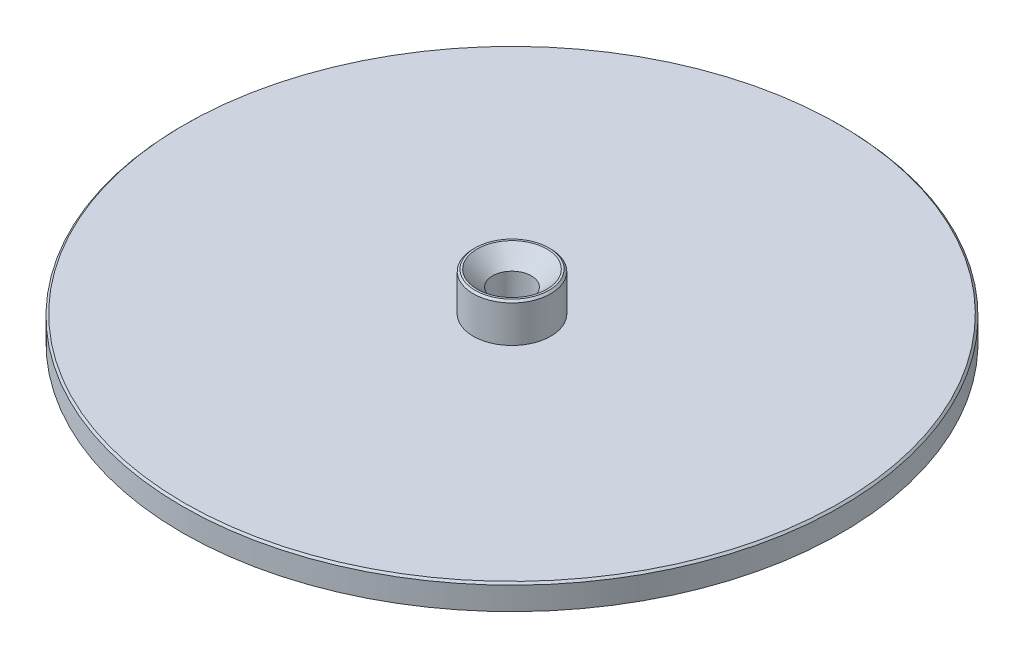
ISO-10303-21;
HEADER;
FILE_DESCRIPTION(('STEP AP214'),'2;1');
FILE_NAME('part.step','',(''),(''),'','','');
FILE_SCHEMA(('AUTOMOTIVE_DESIGN { 1 0 10303 214 1 1 1 1 }'));
ENDSEC;
DATA;
#1=APPLICATION_CONTEXT('core data for automotive mechanical design processes');
#2=APPLICATION_PROTOCOL_DEFINITION('international standard','automotive_design',2000,#1);
#3=PRODUCT_CONTEXT('',#1,'mechanical');
#4=PRODUCT('Part','Part','',(#3));
#5=PRODUCT_RELATED_PRODUCT_CATEGORY('part','',(#4));
#6=PRODUCT_DEFINITION_FORMATION('','',#4);
#7=PRODUCT_DEFINITION_CONTEXT('part definition',#1,'design');
#8=PRODUCT_DEFINITION('design','',#6,#7);
#9=PRODUCT_DEFINITION_SHAPE('','',#8);
#10=(LENGTH_UNIT() NAMED_UNIT(*) SI_UNIT(.MILLI.,.METRE.));
#11=(NAMED_UNIT(*) PLANE_ANGLE_UNIT() SI_UNIT($,.RADIAN.));
#12=(NAMED_UNIT(*) SI_UNIT($,.STERADIAN.) SOLID_ANGLE_UNIT());
#13=UNCERTAINTY_MEASURE_WITH_UNIT(LENGTH_MEASURE(1.E-05),#10,'distance_accuracy_value','');
#14=(GEOMETRIC_REPRESENTATION_CONTEXT(3) GLOBAL_UNCERTAINTY_ASSIGNED_CONTEXT((#13)) GLOBAL_UNIT_ASSIGNED_CONTEXT((#10,
#11,#12)) REPRESENTATION_CONTEXT('',''));
#15=CARTESIAN_POINT('',(0.,0.,0.));
#16=DIRECTION('',(0.,0.,1.));
#17=DIRECTION('',(1.,0.,0.));
#18=AXIS2_PLACEMENT_3D('',#15,#16,#17);
#19=CARTESIAN_POINT('',(0.,8.00000000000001,0.));
#20=DIRECTION('',(0.,1.,0.));
#21=DIRECTION('',(0.,0.,1.));
#22=AXIS2_PLACEMENT_3D('',#19,#20,#21);
#23=PLANE('',#22);
#24=CARTESIAN_POINT('',(0.,8.00000000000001,0.));
#25=DIRECTION('',(0.,1.,0.));
#26=DIRECTION('',(0.,0.,1.));
#27=AXIS2_PLACEMENT_3D('',#24,#25,#26);
#28=CIRCLE('',#27,84.5);
#29=CARTESIAN_POINT('',(0.,8.00000000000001,84.5));
#30=VERTEX_POINT('',#29);
#31=EDGE_CURVE('E73',#30,#30,#28,.T.);
#32=ORIENTED_EDGE('',*,*,#31,.T.);
#33=EDGE_LOOP('',(#32));
#34=FACE_BOUND('',#33,.T.);
#35=CARTESIAN_POINT('',(0.,8.00000000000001,0.));
#36=DIRECTION('',(0.,1.,0.));
#37=DIRECTION('',(0.,0.,1.));
#38=AXIS2_PLACEMENT_3D('',#35,#36,#37);
#39=CIRCLE('',#38,10.);
#40=CARTESIAN_POINT('',(0.,8.00000000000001,10.));
#41=VERTEX_POINT('',#40);
#42=EDGE_CURVE('E93',#41,#41,#39,.T.);
#43=ORIENTED_EDGE('',*,*,#42,.F.);
#44=EDGE_LOOP('',(#43));
#45=FACE_BOUND('',#44,.T.);
#46=ADVANCED_FACE('F43',(#34,#45),#23,.T.);
#47=CARTESIAN_POINT('',(0.,8.00000000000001,0.));
#48=DIRECTION('',(0.,-1.,0.));
#49=DIRECTION('',(0.,0.,-1.));
#50=AXIS2_PLACEMENT_3D('',#47,#48,#49);
#51=CYLINDRICAL_SURFACE('',#50,85.);
#52=CARTESIAN_POINT('',(0.,7.50000000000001,0.));
#53=DIRECTION('',(0.,1.,0.));
#54=DIRECTION('',(0.,0.,1.));
#55=AXIS2_PLACEMENT_3D('',#52,#53,#54);
#56=CIRCLE('',#55,85.);
#57=CARTESIAN_POINT('',(0.,7.50000000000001,85.));
#58=VERTEX_POINT('',#57);
#59=EDGE_CURVE('E69',#58,#58,#56,.F.);
#60=ORIENTED_EDGE('',*,*,#59,.T.);
#61=EDGE_LOOP('',(#60));
#62=FACE_BOUND('',#61,.T.);
#63=CARTESIAN_POINT('',(0.,1.58716815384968,0.));
#64=DIRECTION('',(0.,1.,0.));
#65=DIRECTION('',(0.,0.,1.));
#66=AXIS2_PLACEMENT_3D('',#63,#64,#65);
#67=CIRCLE('',#66,85.);
#68=CARTESIAN_POINT('',(0.,1.58716815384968,85.));
#69=VERTEX_POINT('',#68);
#70=EDGE_CURVE('E89',#69,#69,#67,.T.);
#71=ORIENTED_EDGE('',*,*,#70,.T.);
#72=EDGE_LOOP('',(#71));
#73=FACE_BOUND('',#72,.T.);
#74=ADVANCED_FACE('F102',(#62,#73),#51,.T.);
#75=CARTESIAN_POINT('',(0.,0.,0.));
#76=DIRECTION('',(0.,1.,0.));
#77=DIRECTION('',(0.,0.,1.));
#78=AXIS2_PLACEMENT_3D('',#75,#76,#77);
#79=PLANE('',#78);
#80=CARTESIAN_POINT('',(0.,0.,0.));
#81=DIRECTION('',(0.,1.,0.));
#82=DIRECTION('',(0.,0.,1.));
#83=AXIS2_PLACEMENT_3D('',#80,#81,#82);
#84=CIRCLE('',#83,8.99999999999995);
#85=CARTESIAN_POINT('',(0.,0.,8.99999999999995));
#86=VERTEX_POINT('',#85);
#87=EDGE_CURVE('E10',#86,#86,#84,.T.);
#88=ORIENTED_EDGE('',*,*,#87,.T.);
#89=EDGE_LOOP('',(#88));
#90=FACE_BOUND('',#89,.T.);
#91=CARTESIAN_POINT('',(0.,0.,0.));
#92=DIRECTION('',(0.,1.,0.));
#93=DIRECTION('',(0.,0.,1.));
#94=AXIS2_PLACEMENT_3D('',#91,#92,#93);
#95=CIRCLE('',#94,82.46);
#96=CARTESIAN_POINT('',(0.,0.,82.46));
#97=VERTEX_POINT('',#96);
#98=EDGE_CURVE('E85',#97,#97,#95,.F.);
#99=ORIENTED_EDGE('',*,*,#98,.T.);
#100=EDGE_LOOP('',(#99));
#101=FACE_BOUND('',#100,.T.);
#102=ADVANCED_FACE('F108',(#90,#101),#79,.F.);
#103=CARTESIAN_POINT('',(0.,1.58716815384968,0.));
#104=DIRECTION('',(0.,1.,0.));
#105=DIRECTION('',(0.,0.,1.));
#106=AXIS2_PLACEMENT_3D('',#103,#104,#105);
#107=CONICAL_SURFACE('',#106,85.,1.01229096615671);
#108=ORIENTED_EDGE('',*,*,#98,.F.);
#109=EDGE_LOOP('',(#108));
#110=FACE_BOUND('',#109,.T.);
#111=ORIENTED_EDGE('',*,*,#70,.F.);
#112=EDGE_LOOP('',(#111));
#113=FACE_BOUND('',#112,.T.);
#114=ADVANCED_FACE('F115',(#110,#113),#107,.T.);
#115=CARTESIAN_POINT('',(0.,18.,0.));
#116=DIRECTION('',(0.,-1.,0.));
#117=DIRECTION('',(0.,0.,-1.));
#118=AXIS2_PLACEMENT_3D('',#115,#116,#117);
#119=CYLINDRICAL_SURFACE('',#118,10.);
#120=CARTESIAN_POINT('',(0.,17.5,0.));
#121=DIRECTION('',(0.,1.,0.));
#122=DIRECTION('',(0.,0.,1.));
#123=AXIS2_PLACEMENT_3D('',#120,#121,#122);
#124=CIRCLE('',#123,10.);
#125=CARTESIAN_POINT('',(0.,17.5,10.));
#126=VERTEX_POINT('',#125);
#127=EDGE_CURVE('E77',#126,#126,#124,.F.);
#128=ORIENTED_EDGE('',*,*,#127,.T.);
#129=EDGE_LOOP('',(#128));
#130=FACE_BOUND('',#129,.T.);
#131=ORIENTED_EDGE('',*,*,#42,.T.);
#132=EDGE_LOOP('',(#131));
#133=FACE_BOUND('',#132,.T.);
#134=ADVANCED_FACE('F99',(#130,#133),#119,.T.);
#135=CARTESIAN_POINT('',(0.,18.,0.));
#136=DIRECTION('',(0.,1.,0.));
#137=DIRECTION('',(0.,0.,1.));
#138=AXIS2_PLACEMENT_3D('',#135,#136,#137);
#139=PLANE('',#138);
#140=CARTESIAN_POINT('',(0.,18.,0.));
#141=DIRECTION('',(0.,1.,0.));
#142=DIRECTION('',(0.,0.,1.));
#143=AXIS2_PLACEMENT_3D('',#140,#141,#142);
#144=CIRCLE('',#143,9.00000000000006);
#145=CARTESIAN_POINT('',(0.,18.,9.00000000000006));
#146=VERTEX_POINT('',#145);
#147=EDGE_CURVE('E51',#146,#146,#144,.F.);
#148=ORIENTED_EDGE('',*,*,#147,.T.);
#149=EDGE_LOOP('',(#148));
#150=FACE_BOUND('',#149,.T.);
#151=CARTESIAN_POINT('',(0.,18.,0.));
#152=DIRECTION('',(0.,1.,0.));
#153=DIRECTION('',(0.,0.,1.));
#154=AXIS2_PLACEMENT_3D('',#151,#152,#153);
#155=CIRCLE('',#154,9.50000000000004);
#156=CARTESIAN_POINT('',(0.,18.,9.50000000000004));
#157=VERTEX_POINT('',#156);
#158=EDGE_CURVE('E81',#157,#157,#155,.T.);
#159=ORIENTED_EDGE('',*,*,#158,.T.);
#160=EDGE_LOOP('',(#159));
#161=FACE_BOUND('',#160,.T.);
#162=ADVANCED_FACE('F124',(#150,#161),#139,.T.);
#163=CARTESIAN_POINT('',(0.,18.,0.));
#164=DIRECTION('',(0.,-1.,0.));
#165=DIRECTION('',(0.,0.,-1.));
#166=AXIS2_PLACEMENT_3D('',#163,#164,#165);
#167=CONICAL_SURFACE('',#166,9.50000000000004,0.785398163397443);
#168=ORIENTED_EDGE('',*,*,#127,.F.);
#169=EDGE_LOOP('',(#168));
#170=FACE_BOUND('',#169,.T.);
#171=ORIENTED_EDGE('',*,*,#158,.F.);
#172=EDGE_LOOP('',(#171));
#173=FACE_BOUND('',#172,.T.);
#174=ADVANCED_FACE('F120',(#170,#173),#167,.T.);
#175=CARTESIAN_POINT('',(0.,8.00000000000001,0.));
#176=DIRECTION('',(0.,-1.,0.));
#177=DIRECTION('',(0.,0.,-1.));
#178=AXIS2_PLACEMENT_3D('',#175,#176,#177);
#179=CONICAL_SURFACE('',#178,84.5,0.785398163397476);
#180=ORIENTED_EDGE('',*,*,#59,.F.);
#181=EDGE_LOOP('',(#180));
#182=FACE_BOUND('',#181,.T.);
#183=ORIENTED_EDGE('',*,*,#31,.F.);
#184=EDGE_LOOP('',(#183));
#185=FACE_BOUND('',#184,.T.);
#186=ADVANCED_FACE('F123',(#182,#185),#179,.T.);
#187=CARTESIAN_POINT('',(0.,0.,0.));
#188=DIRECTION('',(0.,1.,0.));
#189=DIRECTION('',(0.,0.,1.));
#190=AXIS2_PLACEMENT_3D('',#187,#188,#189);
#191=CYLINDRICAL_SURFACE('',#190,5.);
#192=CARTESIAN_POINT('',(0.,14.,0.));
#193=DIRECTION('',(0.,1.,0.));
#194=DIRECTION('',(0.,0.,1.));
#195=AXIS2_PLACEMENT_3D('',#192,#193,#194);
#196=CIRCLE('',#195,5.);
#197=CARTESIAN_POINT('',(0.,14.,5.));
#198=VERTEX_POINT('',#197);
#199=EDGE_CURVE('E57',#198,#198,#196,.T.);
#200=ORIENTED_EDGE('',*,*,#199,.T.);
#201=EDGE_LOOP('',(#200));
#202=FACE_BOUND('',#201,.T.);
#203=CARTESIAN_POINT('',(0.,4.,0.));
#204=DIRECTION('',(0.,1.,0.));
#205=DIRECTION('',(0.,0.,1.));
#206=AXIS2_PLACEMENT_3D('',#203,#204,#205);
#207=CIRCLE('',#206,5.);
#208=CARTESIAN_POINT('',(0.,4.,5.));
#209=VERTEX_POINT('',#208);
#210=EDGE_CURVE('E63',#209,#209,#207,.F.);
#211=ORIENTED_EDGE('',*,*,#210,.T.);
#212=EDGE_LOOP('',(#211));
#213=FACE_BOUND('',#212,.T.);
#214=ADVANCED_FACE('F127',(#202,#213),#191,.F.);
#215=CARTESIAN_POINT('',(0.,14.,0.));
#216=DIRECTION('',(0.,1.,0.));
#217=DIRECTION('',(0.,0.,1.));
#218=AXIS2_PLACEMENT_3D('',#215,#216,#217);
#219=CONICAL_SURFACE('',#218,5.,0.785398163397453);
#220=ORIENTED_EDGE('',*,*,#147,.F.);
#221=EDGE_LOOP('',(#220));
#222=FACE_BOUND('',#221,.T.);
#223=ORIENTED_EDGE('',*,*,#199,.F.);
#224=EDGE_LOOP('',(#223));
#225=FACE_BOUND('',#224,.T.);
#226=ADVANCED_FACE('F129',(#222,#225),#219,.F.);
#227=CARTESIAN_POINT('',(0.,0.,0.));
#228=DIRECTION('',(0.,-1.,0.));
#229=DIRECTION('',(0.,0.,-1.));
#230=AXIS2_PLACEMENT_3D('',#227,#228,#229);
#231=CONICAL_SURFACE('',#230,8.99999999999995,0.785398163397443);
#232=ORIENTED_EDGE('',*,*,#210,.F.);
#233=EDGE_LOOP('',(#232));
#234=FACE_BOUND('',#233,.T.);
#235=ORIENTED_EDGE('',*,*,#87,.F.);
#236=EDGE_LOOP('',(#235));
#237=FACE_BOUND('',#236,.T.);
#238=ADVANCED_FACE('F45',(#234,#237),#231,.F.);
#239=CLOSED_SHELL('',(#46,#74,#102,#114,#134,#162,#174,#186,#214,#226,#238));
#240=MANIFOLD_SOLID_BREP('B2',#239);
#241=ADVANCED_BREP_SHAPE_REPRESENTATION('',(#18,#240),#14);
#242=SHAPE_DEFINITION_REPRESENTATION(#9,#241);
ENDSEC;
END-ISO-10303-21;
